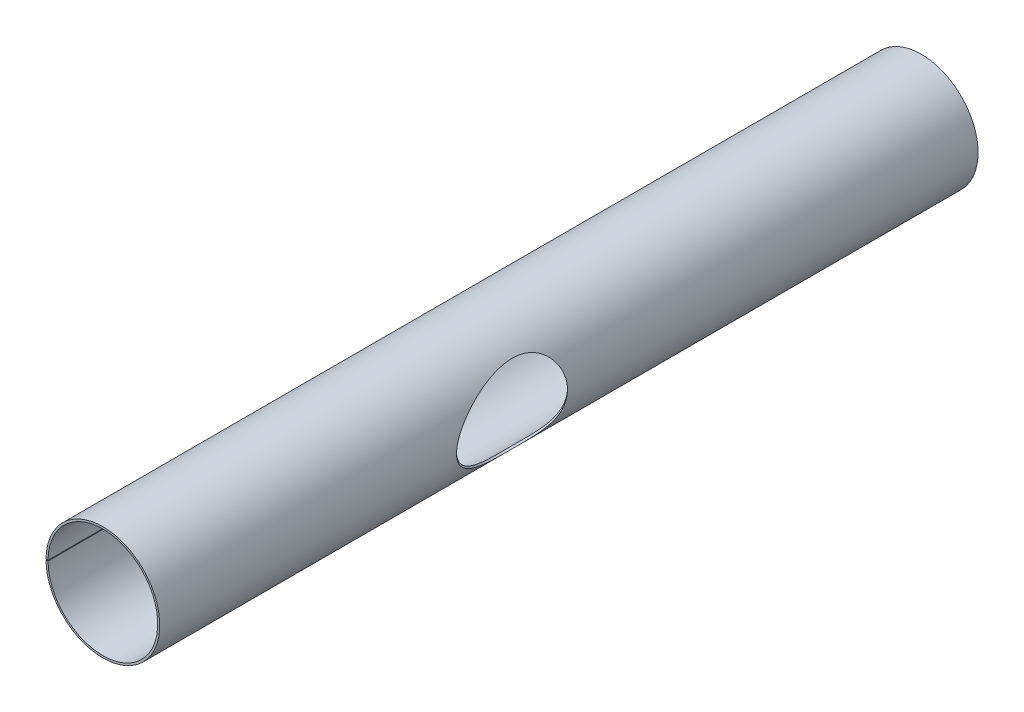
ISO-10303-21;
HEADER;
FILE_DESCRIPTION(('STEP AP214'),'2;1');
FILE_NAME('part.step','',(''),(''),'','','');
FILE_SCHEMA(('AUTOMOTIVE_DESIGN { 1 0 10303 214 1 1 1 1 }'));
ENDSEC;
DATA;
#1=APPLICATION_CONTEXT('core data for automotive mechanical design processes');
#2=APPLICATION_PROTOCOL_DEFINITION('international standard','automotive_design',2000,#1);
#3=PRODUCT_CONTEXT('',#1,'mechanical');
#4=PRODUCT('Part','Part','',(#3));
#5=PRODUCT_RELATED_PRODUCT_CATEGORY('part','',(#4));
#6=PRODUCT_DEFINITION_FORMATION('','',#4);
#7=PRODUCT_DEFINITION_CONTEXT('part definition',#1,'design');
#8=PRODUCT_DEFINITION('design','',#6,#7);
#9=PRODUCT_DEFINITION_SHAPE('','',#8);
#10=(LENGTH_UNIT() NAMED_UNIT(*) SI_UNIT(.MILLI.,.METRE.));
#11=(NAMED_UNIT(*) PLANE_ANGLE_UNIT() SI_UNIT($,.RADIAN.));
#12=(NAMED_UNIT(*) SI_UNIT($,.STERADIAN.) SOLID_ANGLE_UNIT());
#13=UNCERTAINTY_MEASURE_WITH_UNIT(LENGTH_MEASURE(1.E-05),#10,'distance_accuracy_value','');
#14=(GEOMETRIC_REPRESENTATION_CONTEXT(3) GLOBAL_UNCERTAINTY_ASSIGNED_CONTEXT((#13)) GLOBAL_UNIT_ASSIGNED_CONTEXT((#10,
#11,#12)) REPRESENTATION_CONTEXT('',''));
#15=CARTESIAN_POINT('',(0.,0.,0.));
#16=DIRECTION('',(0.,0.,1.));
#17=DIRECTION('',(1.,0.,0.));
#18=AXIS2_PLACEMENT_3D('',#15,#16,#17);
#19=CARTESIAN_POINT('',(0.,0.,500.));
#20=DIRECTION('',(0.,0.,-1.));
#21=DIRECTION('',(-1.,0.,0.));
#22=AXIS2_PLACEMENT_3D('',#19,#20,#21);
#23=CYLINDRICAL_SURFACE('',#22,69.5);
#24=CARTESIAN_POINT('',(69.5,0.,1.61774900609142));
#25=CARTESIAN_POINT('',(69.4999893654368,-1.3417271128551,1.61775043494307));
#26=CARTESIAN_POINT('',(69.4610710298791,-2.68385227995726,1.65845766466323));
#27=CARTESIAN_POINT('',(69.3060443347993,-5.35901378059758,1.82146461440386));
#28=CARTESIAN_POINT('',(69.1899032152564,-6.692046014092,1.9437989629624));
#29=CARTESIAN_POINT('',(68.882250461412,-9.34168040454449,2.27082133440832));
#30=CARTESIAN_POINT('',(68.6906057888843,-10.6582493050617,2.47565473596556));
#31=CARTESIAN_POINT('',(68.2355678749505,-13.2629330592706,2.9683753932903));
#32=CARTESIAN_POINT('',(67.9721822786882,-14.5510509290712,3.25625379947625));
#33=CARTESIAN_POINT('',(67.3786956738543,-17.0897429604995,3.91615355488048));
#34=CARTESIAN_POINT('',(67.0486084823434,-18.3403248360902,4.28815747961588));
#35=CARTESIAN_POINT('',(66.5085375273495,-20.1810397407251,4.9101963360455));
#36=CARTESIAN_POINT('',(66.3209911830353,-20.7888435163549,5.12825367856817));
#37=CARTESIAN_POINT('',(65.9318952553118,-21.9916897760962,5.58594779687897));
#38=CARTESIAN_POINT('',(65.7303470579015,-22.5867335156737,5.82558243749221));
#39=CARTESIAN_POINT('',(65.3143375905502,-23.7629226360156,6.32663504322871));
#40=CARTESIAN_POINT('',(65.0998770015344,-24.3440687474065,6.58805185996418));
#41=CARTESIAN_POINT('',(64.6592511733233,-25.4913469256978,7.13288135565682));
#42=CARTESIAN_POINT('',(64.4330871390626,-26.0574805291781,7.41629177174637));
#43=CARTESIAN_POINT('',(63.9703258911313,-27.1737464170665,8.00538399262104));
#44=CARTESIAN_POINT('',(63.7337277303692,-27.7238772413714,8.31106782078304));
#45=CARTESIAN_POINT('',(63.2515737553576,-28.8069391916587,8.94486846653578));
#46=CARTESIAN_POINT('',(63.0060189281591,-29.3398722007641,9.27298281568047));
#47=CARTESIAN_POINT('',(62.5113730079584,-30.3793408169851,9.94656619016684));
#48=CARTESIAN_POINT('',(62.2623970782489,-30.8861587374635,10.2916840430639));
#49=CARTESIAN_POINT('',(61.7588658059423,-31.8810807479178,11.0039866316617));
#50=CARTESIAN_POINT('',(61.5043111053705,-32.3691869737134,11.3711688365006));
#51=CARTESIAN_POINT('',(60.9912650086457,-33.3258191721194,12.1277793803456));
#52=CARTESIAN_POINT('',(60.732773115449,-33.7943426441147,12.5172105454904));
#53=CARTESIAN_POINT('',(60.2137218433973,-34.7107327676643,13.3182477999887));
#54=CARTESIAN_POINT('',(59.9531627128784,-35.1586018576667,13.7298512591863));
#55=CARTESIAN_POINT('',(59.4321166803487,-36.0323741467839,14.5747503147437));
#56=CARTESIAN_POINT('',(59.1716299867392,-36.4582997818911,15.0080228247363));
#57=CARTESIAN_POINT('',(58.6524524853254,-37.2877888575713,15.8963908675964));
#58=CARTESIAN_POINT('',(58.3937614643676,-37.6913549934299,16.3514837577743));
#59=CARTESIAN_POINT('',(57.8801619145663,-38.4754011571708,17.2831601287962));
#60=CARTESIAN_POINT('',(57.6252532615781,-38.8558819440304,17.7597429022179));
#61=CARTESIAN_POINT('',(57.121233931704,-39.5931057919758,18.7338680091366));
#62=CARTESIAN_POINT('',(56.8721231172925,-39.9498494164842,19.2314098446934));
#63=CARTESIAN_POINT('',(56.4032800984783,-40.6087280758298,20.2020174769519));
#64=CARTESIAN_POINT('',(56.1828922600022,-40.9129057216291,20.6733817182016));
#65=CARTESIAN_POINT('',(55.7500202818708,-41.5008254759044,21.6322817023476));
#66=CARTESIAN_POINT('',(55.5375368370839,-41.7845657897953,22.1198188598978));
#67=CARTESIAN_POINT('',(55.121903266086,-42.33135610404,23.1100914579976));
#68=CARTESIAN_POINT('',(54.918751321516,-42.594410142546,23.6128239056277));
#69=CARTESIAN_POINT('',(54.5229636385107,-43.0998780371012,24.6326661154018));
#70=CARTESIAN_POINT('',(54.3303289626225,-43.342289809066,25.1497773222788));
#71=CARTESIAN_POINT('',(53.9567492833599,-43.8064834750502,26.1971338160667));
#72=CARTESIAN_POINT('',(53.7758010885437,-44.0282710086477,26.727375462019));
#73=CARTESIAN_POINT('',(53.4264493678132,-44.4515430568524,27.7999757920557));
#74=CARTESIAN_POINT('',(53.2580473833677,-44.6530250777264,28.3423359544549));
#75=CARTESIAN_POINT('',(52.7728504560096,-45.2275215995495,29.9858449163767));
#76=CARTESIAN_POINT('',(52.4759920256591,-45.5706756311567,31.1036245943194));
#77=CARTESIAN_POINT('',(52.0505705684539,-46.0547952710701,32.9024059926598));
#78=CARTESIAN_POINT('',(51.9032261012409,-46.2206384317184,33.5725719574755));
#79=CARTESIAN_POINT('',(51.6282701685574,-46.5275652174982,34.9226368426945));
#80=CARTESIAN_POINT('',(51.5006595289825,-46.6686478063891,35.6025361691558));
#81=CARTESIAN_POINT('',(51.2651449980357,-46.9272357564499,36.9702035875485));
#82=CARTESIAN_POINT('',(51.1572427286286,-47.0447391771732,37.6579723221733));
#83=CARTESIAN_POINT('',(50.9608084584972,-47.2574539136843,39.0397571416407));
#84=CARTESIAN_POINT('',(50.8722786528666,-47.3526627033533,39.7337739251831));
#85=CARTESIAN_POINT('',(50.7139411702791,-47.5222019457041,41.1275787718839));
#86=CARTESIAN_POINT('',(50.6441630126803,-47.5964994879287,41.8273741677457));
#87=CARTESIAN_POINT('',(50.5227942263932,-47.7253068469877,43.2303784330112));
#88=CARTESIAN_POINT('',(50.4712054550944,-47.7798146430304,43.9335876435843));
#89=CARTESIAN_POINT('',(50.3425212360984,-47.9155229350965,46.046476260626));
#90=CARTESIAN_POINT('',(50.2914808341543,-47.9689370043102,47.4596603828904));
#91=CARTESIAN_POINT('',(50.2548202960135,-48.0073189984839,50.0583301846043));
#92=CARTESIAN_POINT('',(50.2599427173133,-48.0019722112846,51.2436207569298));
#93=CARTESIAN_POINT('',(50.3093813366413,-47.950156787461,53.6126464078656));
#94=CARTESIAN_POINT('',(50.3537038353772,-47.9036815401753,54.7963812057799));
#95=CARTESIAN_POINT('',(50.4773122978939,-47.7734117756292,57.1606238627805));
#96=CARTESIAN_POINT('',(50.5566203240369,-47.6895937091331,58.3411292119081));
#97=CARTESIAN_POINT('',(50.7462107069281,-47.4878007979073,60.6966151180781));
#98=CARTESIAN_POINT('',(50.8564917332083,-47.3698274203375,61.871595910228));
#99=CARTESIAN_POINT('',(51.104921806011,-47.1017034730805,64.2198760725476));
#100=CARTESIAN_POINT('',(51.2431847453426,-46.9514212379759,65.3931481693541));
#101=CARTESIAN_POINT('',(51.5440008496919,-46.6209810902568,67.7323143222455));
#102=CARTESIAN_POINT('',(51.7065540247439,-46.4408231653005,68.8982083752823));
#103=CARTESIAN_POINT('',(52.0529623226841,-46.0522185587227,71.2216499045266));
#104=CARTESIAN_POINT('',(52.236810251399,-45.8437814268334,72.3792000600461));
#105=CARTESIAN_POINT('',(52.6232607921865,-45.3996594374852,74.6859535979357));
#106=CARTESIAN_POINT('',(52.8258642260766,-45.1639733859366,75.8351566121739));
#107=CARTESIAN_POINT('',(53.2045617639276,-44.7167986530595,77.8915489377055));
#108=CARTESIAN_POINT('',(53.3776495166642,-44.5101598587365,78.8003536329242));
#109=CARTESIAN_POINT('',(53.7332011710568,-44.0802779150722,80.6122051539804));
#110=CARTESIAN_POINT('',(53.9156652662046,-43.8570344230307,81.5152518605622));
#111=CARTESIAN_POINT('',(54.2890108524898,-43.3940289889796,83.3154241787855));
#112=CARTESIAN_POINT('',(54.4798929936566,-43.1542657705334,84.2125493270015));
#113=CARTESIAN_POINT('',(54.8691732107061,-42.658214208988,86.0005995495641));
#114=CARTESIAN_POINT('',(55.0675714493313,-42.4019255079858,86.8915244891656));
#115=CARTESIAN_POINT('',(55.4712791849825,-41.8724033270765,88.6678998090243));
#116=CARTESIAN_POINT('',(55.6765962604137,-41.5991509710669,89.553342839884));
#117=CARTESIAN_POINT('',(56.0931490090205,-41.0357329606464,91.3174293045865));
#118=CARTESIAN_POINT('',(56.3043846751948,-40.7455673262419,92.1960727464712));
#119=CARTESIAN_POINT('',(56.7320301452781,-40.1479980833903,93.9461705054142));
#120=CARTESIAN_POINT('',(56.9484397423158,-39.8405951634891,94.817625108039));
#121=CARTESIAN_POINT('',(57.3857322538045,-39.2081057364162,96.5529394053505));
#122=CARTESIAN_POINT('',(57.6066150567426,-38.8830196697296,97.4167992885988));
#123=CARTESIAN_POINT('',(58.0519985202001,-38.2148733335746,99.1357558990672));
#124=CARTESIAN_POINT('',(58.2764961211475,-37.8718277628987,99.990859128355));
#125=CARTESIAN_POINT('',(58.7286078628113,-37.1668665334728,101.692392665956));
#126=CARTESIAN_POINT('',(58.9562219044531,-36.8049514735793,102.538823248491));
#127=CARTESIAN_POINT('',(59.4139448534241,-36.0613893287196,104.222478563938));
#128=CARTESIAN_POINT('',(59.6440541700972,-35.6797389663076,105.059701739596));
#129=CARTESIAN_POINT('',(60.1060506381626,-34.8958403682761,106.723957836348));
#130=CARTESIAN_POINT('',(60.3379377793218,-34.493592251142,107.550990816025));
#131=CARTESIAN_POINT('',(60.8023893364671,-33.6681356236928,109.192462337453));
#132=CARTESIAN_POINT('',(61.034951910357,-33.2449642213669,110.006920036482));
#133=CARTESIAN_POINT('',(61.5004143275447,-32.3757948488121,111.623511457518));
#134=CARTESIAN_POINT('',(61.7333141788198,-31.9297963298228,112.425644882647));
#135=CARTESIAN_POINT('',(62.1985694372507,-31.0137356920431,114.015865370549));
#136=CARTESIAN_POINT('',(62.4309249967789,-30.5436814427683,114.803956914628));
#137=CARTESIAN_POINT('',(62.8942680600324,-29.5778287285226,116.364554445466));
#138=CARTESIAN_POINT('',(63.1252556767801,-29.0820324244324,117.137061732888));
#139=CARTESIAN_POINT('',(63.5645395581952,-28.107986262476,118.596806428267));
#140=CARTESIAN_POINT('',(63.7730344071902,-27.6320684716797,119.285538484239));
#141=CARTESIAN_POINT('',(64.1872102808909,-26.6558287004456,120.646347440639));
#142=CARTESIAN_POINT('',(64.3928914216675,-26.1555077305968,121.318425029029));
#143=CARTESIAN_POINT('',(64.8006033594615,-25.1284167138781,122.64404721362));
#144=CARTESIAN_POINT('',(65.00263149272,-24.6016283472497,123.297578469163));
#145=CARTESIAN_POINT('',(65.4017322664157,-23.5201121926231,124.582723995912));
#146=CARTESIAN_POINT('',(65.5988049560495,-22.9653846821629,125.214338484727));
#147=CARTESIAN_POINT('',(65.9850699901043,-21.8306405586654,126.447145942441));
#148=CARTESIAN_POINT('',(66.1743130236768,-21.2508636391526,127.048542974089));
#149=CARTESIAN_POINT('',(66.5450181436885,-20.0598992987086,128.222172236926));
#150=CARTESIAN_POINT('',(66.7264794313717,-19.4487086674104,128.794401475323));
#151=CARTESIAN_POINT('',(67.0794296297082,-18.1940688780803,129.903631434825));
#152=CARTESIAN_POINT('',(67.2509336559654,-17.5506715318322,130.440685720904));
#153=CARTESIAN_POINT('',(67.5819737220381,-16.2293090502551,131.474186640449));
#154=CARTESIAN_POINT('',(67.7415142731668,-15.551357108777,131.970648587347));
#155=CARTESIAN_POINT('',(68.0183446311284,-14.286161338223,132.829825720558));
#156=CARTESIAN_POINT('',(68.1380437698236,-13.704822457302,133.200450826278));
#157=CARTESIAN_POINT('',(68.3660150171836,-12.5181051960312,133.904971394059));
#158=CARTESIAN_POINT('',(68.4742883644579,-11.9127294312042,134.238870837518));
#159=CARTESIAN_POINT('',(68.6776280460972,-10.6782383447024,134.864916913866));
#160=CARTESIAN_POINT('',(68.772689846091,-10.0491149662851,135.157049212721));
#161=CARTESIAN_POINT('',(68.9476103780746,-8.76893238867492,135.693871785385));
#162=CARTESIAN_POINT('',(69.0274723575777,-8.11787791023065,135.938572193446));
#163=CARTESIAN_POINT('',(69.1708636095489,-6.78916686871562,136.377473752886));
#164=CARTESIAN_POINT('',(69.2342065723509,-6.11129852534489,136.571099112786));
#165=CARTESIAN_POINT('',(69.3415984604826,-4.73979632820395,136.89913679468));
#166=CARTESIAN_POINT('',(69.3856480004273,-4.04616297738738,137.033551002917));
#167=CARTESIAN_POINT('',(69.4530054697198,-2.64923120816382,137.239010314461));
#168=CARTESIAN_POINT('',(69.4763344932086,-1.94594336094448,137.310119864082));
#169=CARTESIAN_POINT('',(69.5015155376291,-0.535427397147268,137.386872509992));
#170=CARTESIAN_POINT('',(69.5033694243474,0.171800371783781,137.392521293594));
#171=CARTESIAN_POINT('',(69.4864326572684,1.51335646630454,137.340900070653));
#172=CARTESIAN_POINT('',(69.469671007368,2.14795913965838,137.289813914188));
#173=CARTESIAN_POINT('',(69.4191632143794,3.41007365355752,137.135792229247));
#174=CARTESIAN_POINT('',(69.3854185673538,4.03758611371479,137.032861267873));
#175=CARTESIAN_POINT('',(69.3018191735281,5.28175335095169,136.777652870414));
#176=CARTESIAN_POINT('',(69.2519543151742,5.89840105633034,136.625344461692));
#177=CARTESIAN_POINT('',(69.1373405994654,7.11709175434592,136.274893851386));
#178=CARTESIAN_POINT('',(69.0725895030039,7.71913253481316,136.076744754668));
#179=CARTESIAN_POINT('',(68.9059892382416,9.102001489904,135.56625568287));
#180=CARTESIAN_POINT('',(68.7989485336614,9.87628926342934,135.237809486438));
#181=CARTESIAN_POINT('',(68.5644606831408,11.3909110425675,134.516733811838));
#182=CARTESIAN_POINT('',(68.4370067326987,12.1312336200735,134.12408293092));
#183=CARTESIAN_POINT('',(68.0285255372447,14.3017586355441,132.862428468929));
#184=CARTESIAN_POINT('',(67.7216231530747,15.6796141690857,131.910467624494));
#185=CARTESIAN_POINT('',(67.2546859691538,17.5320531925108,130.452259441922));
#186=CARTESIAN_POINT('',(67.1134075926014,18.0647013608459,130.009934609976));
#187=CARTESIAN_POINT('',(66.8240481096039,19.1073036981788,129.101336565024));
#188=CARTESIAN_POINT('',(66.6759684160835,19.617262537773,128.635068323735));
#189=CARTESIAN_POINT('',(66.374036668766,20.6157605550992,127.681346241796));
#190=CARTESIAN_POINT('',(66.2201805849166,21.1042842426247,127.193877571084));
#191=CARTESIAN_POINT('',(65.9077280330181,22.0606988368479,126.200549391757));
#192=CARTESIAN_POINT('',(65.7491313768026,22.5285889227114,125.694689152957));
#193=CARTESIAN_POINT('',(65.4277590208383,23.4455714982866,124.665896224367));
#194=CARTESIAN_POINT('',(65.2649766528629,23.894630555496,124.142935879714));
#195=CARTESIAN_POINT('',(64.936221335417,24.774127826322,123.082635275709));
#196=CARTESIAN_POINT('',(64.7702484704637,25.2045665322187,122.545295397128));
#197=CARTESIAN_POINT('',(64.2685686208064,26.4693171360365,120.91431614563));
#198=CARTESIAN_POINT('',(63.928998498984,27.2773505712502,119.801391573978));
#199=CARTESIAN_POINT('',(63.2439725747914,28.8300057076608,117.534772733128));
#200=CARTESIAN_POINT('',(62.8985184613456,29.5746452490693,116.381090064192));
#201=CARTESIAN_POINT('',(62.2048702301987,31.0070527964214,114.039513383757));
#202=CARTESIAN_POINT('',(61.856675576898,31.6948093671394,112.851612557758));
#203=CARTESIAN_POINT('',(61.1601536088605,33.0188656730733,110.446224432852));
#204=CARTESIAN_POINT('',(60.8118264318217,33.6551213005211,109.228712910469));
#205=CARTESIAN_POINT('',(60.1178476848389,34.8796430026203,106.769211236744));
#206=CARTESIAN_POINT('',(59.7721959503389,35.4679120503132,105.527222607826));
#207=CARTESIAN_POINT('',(59.0843918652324,36.6022727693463,103.016471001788));
#208=CARTESIAN_POINT('',(58.7422606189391,37.1481746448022,101.747616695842));
#209=CARTESIAN_POINT('',(58.0652462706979,38.1977365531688,99.1906653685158));
#210=CARTESIAN_POINT('',(57.7303632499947,38.7013961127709,97.9025681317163));
#211=CARTESIAN_POINT('',(57.0702687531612,39.6683358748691,95.309607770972));
#212=CARTESIAN_POINT('',(56.7450527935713,40.131634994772,94.0047528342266));
#213=CARTESIAN_POINT('',(56.1064844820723,41.0196467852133,91.3791146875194));
#214=CARTESIAN_POINT('',(55.793132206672,41.4443592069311,90.058331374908));
#215=CARTESIAN_POINT('',(55.1413168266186,42.3085650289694,87.2306075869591));
#216=CARTESIAN_POINT('',(54.8048286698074,42.7428979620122,85.7216312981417));
#217=CARTESIAN_POINT('',(54.1542032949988,43.5642822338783,82.6860448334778));
#218=CARTESIAN_POINT('',(53.840066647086,43.9513323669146,81.1594342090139));
#219=CARTESIAN_POINT('',(53.238485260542,44.6781419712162,78.0883860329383));
#220=CARTESIAN_POINT('',(52.9510625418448,45.0178625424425,76.543934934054));
#221=CARTESIAN_POINT('',(52.4085168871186,45.6483330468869,73.4394268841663));
#222=CARTESIAN_POINT('',(52.1533930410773,45.9390843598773,71.8793703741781));
#223=CARTESIAN_POINT('',(51.683042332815,46.4675966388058,68.7539490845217));
#224=CARTESIAN_POINT('',(51.4675891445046,46.7056598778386,67.1886698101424));
#225=CARTESIAN_POINT('',(51.0818542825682,47.1272322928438,64.0448579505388));
#226=CARTESIAN_POINT('',(50.9115775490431,47.3107355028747,62.4663239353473));
#227=CARTESIAN_POINT('',(50.6964697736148,47.5408120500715,60.0917023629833));
#228=CARTESIAN_POINT('',(50.6315150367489,47.6099433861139,59.2995565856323));
#229=CARTESIAN_POINT('',(50.5161373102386,47.7323474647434,57.712998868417));
#230=CARTESIAN_POINT('',(50.465713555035,47.7856210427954,56.918587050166));
#231=CARTESIAN_POINT('',(50.3806289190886,47.8753177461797,55.3281755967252));
#232=CARTESIAN_POINT('',(50.3459637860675,47.9117454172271,54.5321764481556));
#233=CARTESIAN_POINT('',(50.2936669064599,47.9666397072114,52.9390376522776));
#234=CARTESIAN_POINT('',(50.2760338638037,47.9851076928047,52.1418980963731));
#235=CARTESIAN_POINT('',(50.2605817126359,48.0012920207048,50.6839229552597));
#236=CARTESIAN_POINT('',(50.2598836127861,48.0020235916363,50.0231522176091));
#237=CARTESIAN_POINT('',(50.2718628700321,47.9894757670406,48.7019117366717));
#238=CARTESIAN_POINT('',(50.2845395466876,47.9761970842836,48.0414419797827));
#239=CARTESIAN_POINT('',(50.3437902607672,47.9140573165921,46.0613895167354));
#240=CARTESIAN_POINT('',(50.4115824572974,47.8428951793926,44.742968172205));
#241=CARTESIAN_POINT('',(50.6095551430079,47.6334356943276,42.1169375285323));
#242=CARTESIAN_POINT('',(50.7396847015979,47.4951931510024,40.8093202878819));
#243=CARTESIAN_POINT('',(50.9850300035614,47.2312451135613,38.8619687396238));
#244=CARTESIAN_POINT('',(51.0751853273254,47.1338152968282,38.2151136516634));
#245=CARTESIAN_POINT('',(51.2725722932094,46.9190236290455,36.9273691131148));
#246=CARTESIAN_POINT('',(51.379802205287,46.8016637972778,36.2864790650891));
#247=CARTESIAN_POINT('',(51.6130582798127,46.5443092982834,35.0037204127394));
#248=CARTESIAN_POINT('',(51.7393114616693,46.4040392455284,34.3619481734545));
#249=CARTESIAN_POINT('',(52.0095190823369,46.100988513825,33.0875755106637));
#250=CARTESIAN_POINT('',(52.1534713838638,45.938210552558,32.4549739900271));
#251=CARTESIAN_POINT('',(52.4588273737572,45.5892003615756,31.2004437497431));
#252=CARTESIAN_POINT('',(52.6202331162,45.4029653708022,30.5785162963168));
#253=CARTESIAN_POINT('',(52.9598951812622,45.0063068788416,29.3471819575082));
#254=CARTESIAN_POINT('',(53.1381493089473,44.7958865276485,28.7377734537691));
#255=CARTESIAN_POINT('',(53.5105826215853,44.3503303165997,27.5333439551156));
#256=CARTESIAN_POINT('',(53.7047546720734,44.1152055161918,26.9383166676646));
#257=CARTESIAN_POINT('',(54.1079178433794,43.6197797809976,25.7640599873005));
#258=CARTESIAN_POINT('',(54.3169070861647,43.3594820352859,25.1848286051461));
#259=CARTESIAN_POINT('',(54.7483050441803,42.8134806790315,24.0435972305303));
#260=CARTESIAN_POINT('',(54.9707136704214,42.5277772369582,23.4815971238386));
#261=CARTESIAN_POINT('',(55.4272954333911,41.9309676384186,22.3761855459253));
#262=CARTESIAN_POINT('',(55.6614682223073,41.6198622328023,21.8327735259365));
#263=CARTESIAN_POINT('',(56.1108423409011,41.0115661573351,20.8301612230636));
#264=CARTESIAN_POINT('',(56.3249184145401,40.7172341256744,20.3687177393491));
#265=CARTESIAN_POINT('',(56.7594218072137,40.1093208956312,19.461707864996));
#266=CARTESIAN_POINT('',(56.9798496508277,39.7957381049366,19.0161427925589));
#267=CARTESIAN_POINT('',(57.4256061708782,39.1497600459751,18.1415516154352));
#268=CARTESIAN_POINT('',(57.6509339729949,38.8173681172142,17.7125225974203));
#269=CARTESIAN_POINT('',(58.1051334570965,38.1341286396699,16.8712940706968));
#270=CARTESIAN_POINT('',(58.3340054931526,37.7832792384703,16.4590962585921));
#271=CARTESIAN_POINT('',(58.7939505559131,37.0635103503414,15.6517075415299));
#272=CARTESIAN_POINT('',(59.025024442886,36.6945835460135,15.2565236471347));
#273=CARTESIAN_POINT('',(59.4878872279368,35.9393600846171,14.4835291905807));
#274=CARTESIAN_POINT('',(59.7196761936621,35.5530617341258,14.1057203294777));
#275=CARTESIAN_POINT('',(60.4140164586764,34.3690665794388,12.9986139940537));
#276=CARTESIAN_POINT('',(60.875648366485,33.5461033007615,12.2954506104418));
#277=CARTESIAN_POINT('',(61.7841905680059,31.8416931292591,10.961811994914));
#278=CARTESIAN_POINT('',(62.2311485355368,30.9604711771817,10.331080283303));
#279=CARTESIAN_POINT('',(63.1030269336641,29.1423112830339,9.13850676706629));
#280=CARTESIAN_POINT('',(63.5279476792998,28.2053741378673,8.57666397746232));
#281=CARTESIAN_POINT('',(64.3478760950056,26.2810800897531,7.52057234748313));
#282=CARTESIAN_POINT('',(64.742870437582,25.2937010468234,7.02635354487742));
#283=CARTESIAN_POINT('',(65.4957976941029,23.2746973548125,6.10458062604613));
#284=CARTESIAN_POINT('',(65.8537293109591,22.2430711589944,5.67702884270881));
#285=CARTESIAN_POINT('',(66.5608759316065,20.0344033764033,4.84722141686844));
#286=CARTESIAN_POINT('',(66.905494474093,18.8532493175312,4.45197143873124));
#287=CARTESIAN_POINT('',(67.5360427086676,16.4521763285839,3.73960004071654));
#288=CARTESIAN_POINT('',(67.8219630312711,15.2322512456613,3.42249109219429));
#289=CARTESIAN_POINT('',(68.3295387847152,12.7636155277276,2.86576383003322));
#290=CARTESIAN_POINT('',(68.5512838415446,11.5149476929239,2.62603739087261));
#291=CARTESIAN_POINT('',(68.9271075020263,8.99582786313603,2.22273368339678));
#292=CARTESIAN_POINT('',(69.0812127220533,7.72538464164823,2.05912646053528));
#293=CARTESIAN_POINT('',(69.2997783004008,5.3797798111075,1.82800460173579));
#294=CARTESIAN_POINT('',(69.3747856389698,4.30670557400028,1.74914197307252));
#295=CARTESIAN_POINT('',(69.4498692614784,2.69362011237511,1.67030108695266));
#296=CARTESIAN_POINT('',(69.46865923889,2.15534022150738,1.65059630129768));
#297=CARTESIAN_POINT('',(69.4937281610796,1.07806172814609,1.62431848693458));
#298=CARTESIAN_POINT('',(69.500004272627,0.539062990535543,1.61774843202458));
#299=CARTESIAN_POINT('',(69.5,0.,1.61774900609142));
#300=B_SPLINE_CURVE_WITH_KNOTS('',3,(#24,#25,#26,#27,#28,#29,#30,#31,#32,#33,#34,#35,#36,#37,
#38,#39,#40,#41,#42,#43,#44,#45,#46,#47,#48,#49,#50,#51,#52,#53,#54,#55,#56,#57,#58,#59,#60,#61,
#62,#63,#64,#65,#66,#67,#68,#69,#70,#71,#72,#73,#74,#75,#76,#77,#78,#79,#80,#81,#82,#83,#84,#85,
#86,#87,#88,#89,#90,#91,#92,#93,#94,#95,#96,#97,#98,#99,#100,#101,#102,#103,#104,#105,#106,#107,
#108,#109,#110,#111,#112,#113,#114,#115,#116,#117,#118,#119,#120,#121,#122,#123,#124,#125,#126,
#127,#128,#129,#130,#131,#132,#133,#134,#135,#136,#137,#138,#139,#140,#141,#142,#143,#144,#145,
#146,#147,#148,#149,#150,#151,#152,#153,#154,#155,#156,#157,#158,#159,#160,#161,#162,#163,#164,
#165,#166,#167,#168,#169,#170,#171,#172,#173,#174,#175,#176,#177,#178,#179,#180,#181,#182,#183,
#184,#185,#186,#187,#188,#189,#190,#191,#192,#193,#194,#195,#196,#197,#198,#199,#200,#201,#202,
#203,#204,#205,#206,#207,#208,#209,#210,#211,#212,#213,#214,#215,#216,#217,#218,#219,#220,#221,
#222,#223,#224,#225,#226,#227,#228,#229,#230,#231,#232,#233,#234,#235,#236,#237,#238,#239,#240,
#241,#242,#243,#244,#245,#246,#247,#248,#249,#250,#251,#252,#253,#254,#255,#256,#257,#258,#259,
#260,#261,#262,#263,#264,#265,#266,#267,#268,#269,#270,#271,#272,#273,#274,#275,#276,#277,#278,
#279,#280,#281,#282,#283,#284,#285,#286,#287,#288,#289,#290,#291,#292,#293,#294,#295,#296,#297,
#298,#299),.UNSPECIFIED.,.T.,.F.,(4,2,2,2,2,2,2,2,2,2,2,2,2,2,2,2,2,2,2,2,2,2,2,2,2,2,2,2,2,2,2,
2,2,2,2,2,2,2,2,2,2,2,2,2,2,2,2,2,2,2,2,2,2,2,2,2,2,2,2,2,2,2,2,2,2,2,2,2,2,2,2,2,2,2,2,2,2,2,2,
2,2,2,2,2,2,2,2,2,2,2,2,2,2,2,2,2,2,2,2,2,2,2,2,2,2,2,2,2,2,2,2,2,2,2,2,2,2,2,2,2,2,2,2,2,2,2,2,
2,2,2,2,2,2,2,2,2,2,4),(0.,4.02468972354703,8.05108792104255,12.0846126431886,16.1177076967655,
20.1499681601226,22.1667257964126,24.1832840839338,26.1997361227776,28.215980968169,
30.2324092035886,32.2486158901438,34.2333266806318,36.2178102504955,38.2025464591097,
40.1870477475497,42.1694779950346,44.1516687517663,46.1337943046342,48.1158727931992,
49.9234503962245,51.7311865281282,53.5385688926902,55.3461335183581,57.1532024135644,
58.9604929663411,62.5743782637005,64.6915321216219,66.8087745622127,68.9261911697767,
71.0438475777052,73.1648183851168,75.2860057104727,79.527641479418,83.0822308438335,
86.6373916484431,90.1947975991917,93.7520507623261,97.3240849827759,100.896120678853,
104.466953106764,108.037942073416,110.881550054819,113.725216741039,116.569103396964,
119.413051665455,122.260223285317,125.107391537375,127.954446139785,130.801429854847,
133.646118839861,136.490717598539,139.335790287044,142.180846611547,145.021026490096,
147.86127467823,150.700599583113,153.539686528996,156.127444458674,158.715095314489,
161.304562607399,163.894004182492,166.462588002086,169.031434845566,171.596274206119,
174.160141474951,176.258086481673,178.355803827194,180.454239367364,182.552226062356,
184.6729408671,186.793588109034,188.912073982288,191.030375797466,192.938614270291,
194.846684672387,196.755954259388,198.665511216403,201.205029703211,203.74539647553,
208.832233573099,210.951818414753,213.070964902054,215.191618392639,217.312356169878,
219.436712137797,221.561011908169,225.80827635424,230.054341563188,234.301258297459,
238.551774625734,242.802027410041,247.070336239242,251.338692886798,255.605038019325,
259.871410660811,264.688126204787,269.504964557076,274.325738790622,279.146377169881,
283.938597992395,288.731342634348,291.124519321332,293.517569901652,295.909974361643,
298.302196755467,300.284234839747,302.266172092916,306.229461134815,310.189517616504,
312.17006364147,314.150409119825,316.156596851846,318.16254256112,320.168724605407,
322.174645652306,324.179672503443,326.184445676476,328.189205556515,330.193906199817,
331.95644918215,333.71913814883,335.481515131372,337.244069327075,339.007342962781,
340.770788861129,344.296867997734,347.810048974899,351.323179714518,354.837865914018,
358.352675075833,362.225282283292,366.098507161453,369.966296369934,373.832562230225,
377.065744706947,378.682370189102,380.299361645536),.UNSPECIFIED.);
#301=CARTESIAN_POINT('',(69.5,0.,1.61774900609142));
#302=VERTEX_POINT('',#301);
#303=EDGE_CURVE('E107',#302,#302,#300,.T.);
#304=ORIENTED_EDGE('',*,*,#303,.T.);
#305=EDGE_LOOP('',(#304));
#306=FACE_BOUND('',#305,.T.);
#307=CARTESIAN_POINT('',(0.,0.,-500.));
#308=DIRECTION('',(0.,0.,1.));
#309=DIRECTION('',(1.,0.,0.));
#310=AXIS2_PLACEMENT_3D('',#307,#308,#309);
#311=CIRCLE('',#310,69.5);
#312=CARTESIAN_POINT('',(-69.4982014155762,-0.49999999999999,-500.));
#313=VERTEX_POINT('',#312);
#314=CARTESIAN_POINT('',(-69.4982014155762,0.499999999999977,-500.));
#315=VERTEX_POINT('',#314);
#316=EDGE_CURVE('E105',#313,#315,#311,.T.);
#317=ORIENTED_EDGE('',*,*,#316,.T.);
#318=DIRECTION('',(0.,0.,-1.));
#319=VECTOR('',#318,1.);
#320=CARTESIAN_POINT('',(-69.4982014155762,0.499999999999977,500.));
#321=LINE('',#320,#319);
#322=CARTESIAN_POINT('',(-69.4982014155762,0.499999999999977,500.));
#323=VERTEX_POINT('',#322);
#324=EDGE_CURVE('E11',#323,#315,#321,.T.);
#325=ORIENTED_EDGE('',*,*,#324,.F.);
#326=CARTESIAN_POINT('',(0.,0.,500.));
#327=DIRECTION('',(0.,0.,1.));
#328=DIRECTION('',(1.,0.,0.));
#329=AXIS2_PLACEMENT_3D('',#326,#327,#328);
#330=CIRCLE('',#329,69.5);
#331=CARTESIAN_POINT('',(-69.4982014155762,-0.49999999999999,500.));
#332=VERTEX_POINT('',#331);
#333=EDGE_CURVE('E81',#332,#323,#330,.T.);
#334=ORIENTED_EDGE('',*,*,#333,.F.);
#335=DIRECTION('',(0.,0.,-1.));
#336=VECTOR('',#335,1.);
#337=CARTESIAN_POINT('',(-69.4982014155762,-0.49999999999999,500.));
#338=LINE('',#337,#336);
#339=EDGE_CURVE('E57',#332,#313,#338,.T.);
#340=ORIENTED_EDGE('',*,*,#339,.T.);
#341=EDGE_LOOP('',(#317,#325,#334,#340));
#342=FACE_BOUND('',#341,.T.);
#343=ADVANCED_FACE('F35',(#306,#342),#23,.T.);
#344=CARTESIAN_POINT('',(-67.0382650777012,0.482302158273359,500.));
#345=DIRECTION('',(-0.00719424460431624,-0.999974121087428,0.));
#346=DIRECTION('',(0.999974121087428,-0.00719424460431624,0.));
#347=AXIS2_PLACEMENT_3D('',#344,#345,#346);
#348=PLANE('',#347);
#349=DIRECTION('',(-0.999974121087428,0.00719424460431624,0.));
#350=VECTOR('',#349,1.);
#351=CARTESIAN_POINT('',(-67.0382650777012,0.482302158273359,-500.));
#352=LINE('',#351,#350);
#353=CARTESIAN_POINT('',(-67.0382650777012,0.482302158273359,-500.));
#354=VERTEX_POINT('',#353);
#355=EDGE_CURVE('E90',#354,#315,#352,.T.);
#356=ORIENTED_EDGE('',*,*,#355,.F.);
#357=DIRECTION('',(0.,0.,-1.));
#358=VECTOR('',#357,1.);
#359=CARTESIAN_POINT('',(-67.0382650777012,0.482302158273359,500.));
#360=LINE('',#359,#358);
#361=CARTESIAN_POINT('',(-67.0382650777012,0.482302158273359,500.));
#362=VERTEX_POINT('',#361);
#363=EDGE_CURVE('E49',#362,#354,#360,.T.);
#364=ORIENTED_EDGE('',*,*,#363,.F.);
#365=DIRECTION('',(-0.999974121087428,0.00719424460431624,0.));
#366=VECTOR('',#365,1.);
#367=CARTESIAN_POINT('',(-67.0382650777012,0.482302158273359,500.));
#368=LINE('',#367,#366);
#369=EDGE_CURVE('E88',#362,#323,#368,.T.);
#370=ORIENTED_EDGE('',*,*,#369,.T.);
#371=ORIENTED_EDGE('',*,*,#324,.T.);
#372=EDGE_LOOP('',(#356,#364,#370,#371));
#373=FACE_BOUND('',#372,.T.);
#374=ADVANCED_FACE('F87',(#373),#348,.T.);
#375=CARTESIAN_POINT('',(0.,0.,500.));
#376=DIRECTION('',(0.,0.,-1.));
#377=DIRECTION('',(-1.,0.,0.));
#378=AXIS2_PLACEMENT_3D('',#375,#376,#377);
#379=CYLINDRICAL_SURFACE('',#378,67.04);
#380=CARTESIAN_POINT('',(67.04,0.,-0.842250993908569));
#381=CARTESIAN_POINT('',(67.0399885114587,-1.34541357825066,-0.842249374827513));
#382=CARTESIAN_POINT('',(66.999426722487,-2.69110860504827,-0.802756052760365));
#383=CARTESIAN_POINT('',(66.8378363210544,-5.37322159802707,-0.644618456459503));
#384=CARTESIAN_POINT('',(66.7167843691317,-6.70963675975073,-0.525951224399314));
#385=CARTESIAN_POINT('',(66.3961255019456,-9.36517668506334,-0.208816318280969));
#386=CARTESIAN_POINT('',(66.1964226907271,-10.6842783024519,-0.0102512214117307));
#387=CARTESIAN_POINT('',(65.7220759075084,-13.2939644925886,0.467395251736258));
#388=CARTESIAN_POINT('',(65.4474373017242,-14.58455110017,0.746470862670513));
#389=CARTESIAN_POINT('',(64.8282561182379,-17.1280663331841,1.3862563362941));
#390=CARTESIAN_POINT('',(64.4837292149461,-18.3810033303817,1.74694789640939));
#391=CARTESIAN_POINT('',(63.9196056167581,-20.2252295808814,2.35022402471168));
#392=CARTESIAN_POINT('',(63.7236424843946,-20.8341974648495,2.56172571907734));
#393=CARTESIAN_POINT('',(63.3169135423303,-22.039378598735,3.00573472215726));
#394=CARTESIAN_POINT('',(63.1061491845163,-22.6355930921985,3.23823997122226));
#395=CARTESIAN_POINT('',(62.6708487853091,-23.814306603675,3.72456003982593));
#396=CARTESIAN_POINT('',(62.4463096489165,-24.3968024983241,3.97837965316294));
#397=CARTESIAN_POINT('',(61.9847256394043,-25.5468042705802,4.50752945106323));
#398=CARTESIAN_POINT('',(61.7476820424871,-26.1143116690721,4.78285744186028));
#399=CARTESIAN_POINT('',(61.2623658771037,-27.2333641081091,5.35535617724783));
#400=CARTESIAN_POINT('',(61.0140922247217,-27.7849075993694,5.65252903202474));
#401=CARTESIAN_POINT('',(60.5078095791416,-28.8708404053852,6.26895107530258));
#402=CARTESIAN_POINT('',(60.2498016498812,-29.4052315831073,6.58819785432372));
#403=CARTESIAN_POINT('',(59.7288539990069,-30.4493308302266,7.24497811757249));
#404=CARTESIAN_POINT('',(59.4660152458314,-30.9592629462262,7.58223542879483));
#405=CARTESIAN_POINT('',(58.9340279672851,-31.9603378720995,8.27880220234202));
#406=CARTESIAN_POINT('',(58.664880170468,-32.4514828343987,8.63810912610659));
#407=CARTESIAN_POINT('',(58.1219788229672,-33.4141073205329,9.37907806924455));
#408=CARTESIAN_POINT('',(57.8482246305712,-33.8855840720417,9.76074322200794));
#409=CARTESIAN_POINT('',(57.2980776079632,-34.8077597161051,10.5464898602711));
#410=CARTESIAN_POINT('',(57.0216851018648,-35.258461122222,10.9505686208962));
#411=CARTESIAN_POINT('',(56.4685728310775,-36.1376715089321,11.7807531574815));
#412=CARTESIAN_POINT('',(56.1918538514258,-36.5662063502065,12.2068320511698));
#413=CARTESIAN_POINT('',(55.6399016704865,-37.4007109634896,13.081348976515));
#414=CARTESIAN_POINT('',(55.3646682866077,-37.8066835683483,13.5297841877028));
#415=CARTESIAN_POINT('',(54.8178493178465,-38.5952746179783,14.4488310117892));
#416=CARTESIAN_POINT('',(54.546263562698,-38.9778941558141,14.9194415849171));
#417=CARTESIAN_POINT('',(54.0089564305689,-39.71906011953,15.8824583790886));
#418=CARTESIAN_POINT('',(53.7432348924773,-40.0776072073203,16.3748640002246));
#419=CARTESIAN_POINT('',(53.2445525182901,-40.7373753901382,17.3334277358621));
#420=CARTESIAN_POINT('',(53.0108650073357,-41.0408141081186,17.7976833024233));
#421=CARTESIAN_POINT('',(52.551704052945,-41.6271386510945,18.7430111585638));
#422=CARTESIAN_POINT('',(52.3262313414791,-41.9100226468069,19.2240849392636));
#423=CARTESIAN_POINT('',(51.8851018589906,-42.4549252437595,20.2021331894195));
#424=CARTESIAN_POINT('',(51.6694430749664,-42.7169481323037,20.6991043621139));
#425=CARTESIAN_POINT('',(51.2492836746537,-43.2201339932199,21.7081703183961));
#426=CARTESIAN_POINT('',(51.044784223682,-43.4612947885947,22.2202666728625));
#427=CARTESIAN_POINT('',(50.6483264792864,-43.9226719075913,23.2582131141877));
#428=CARTESIAN_POINT('',(50.4563620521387,-44.1428984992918,23.7840562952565));
#429=CARTESIAN_POINT('',(50.0859129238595,-44.5627796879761,24.8486307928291));
#430=CARTESIAN_POINT('',(49.907429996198,-44.7624315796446,25.3873637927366));
#431=CARTESIAN_POINT('',(49.5648346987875,-45.1414891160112,26.4763923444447));
#432=CARTESIAN_POINT('',(49.4007223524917,-45.3208947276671,27.0266879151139));
#433=CARTESIAN_POINT('',(49.0875037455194,-45.6599588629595,28.1375429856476));
#434=CARTESIAN_POINT('',(48.9383979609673,-45.8196167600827,28.6981028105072));
#435=CARTESIAN_POINT('',(48.6386122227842,-46.1378413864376,29.8960952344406));
#436=CARTESIAN_POINT('',(48.4898977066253,-46.2939697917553,30.5346683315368));
#437=CARTESIAN_POINT('',(48.2120860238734,-46.5832219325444,31.8212164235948));
#438=CARTESIAN_POINT('',(48.0829894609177,-46.7163449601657,32.4691917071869));
#439=CARTESIAN_POINT('',(47.8443548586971,-46.9607120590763,33.7728367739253));
#440=CARTESIAN_POINT('',(47.7348177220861,-47.0719551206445,34.4285069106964));
#441=CARTESIAN_POINT('',(47.5349751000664,-47.2737547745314,35.7459865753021));
#442=CARTESIAN_POINT('',(47.4446717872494,-47.3643090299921,36.4077967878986));
#443=CARTESIAN_POINT('',(47.2826429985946,-47.5260605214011,37.7371096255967));
#444=CARTESIAN_POINT('',(47.2109472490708,-47.5972267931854,38.4046196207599));
#445=CARTESIAN_POINT('',(47.085603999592,-47.7212227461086,39.7430507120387));
#446=CARTESIAN_POINT('',(47.0319583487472,-47.7740505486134,40.4139721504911));
#447=CARTESIAN_POINT('',(46.8968893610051,-47.9067892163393,42.4300684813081));
#448=CARTESIAN_POINT('',(46.8413079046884,-47.9609811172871,43.7787943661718));
#449=CARTESIAN_POINT('',(46.7956157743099,-48.005540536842,46.2664775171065));
#450=CARTESIAN_POINT('',(46.7966109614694,-48.0045783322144,47.4051891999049));
#451=CARTESIAN_POINT('',(46.8378115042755,-47.9643819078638,49.6813834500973));
#452=CARTESIAN_POINT('',(46.8780233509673,-47.9251413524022,50.8188657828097));
#453=CARTESIAN_POINT('',(46.9933356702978,-47.8120737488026,53.0909836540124));
#454=CARTESIAN_POINT('',(47.068458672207,-47.7382243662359,54.2256168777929));
#455=CARTESIAN_POINT('',(47.2495374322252,-47.5590054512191,56.4898173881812));
#456=CARTESIAN_POINT('',(47.3554918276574,-47.4536373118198,57.6193848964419));
#457=CARTESIAN_POINT('',(47.5950661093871,-47.2133471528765,59.877217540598));
#458=CARTESIAN_POINT('',(47.728799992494,-47.0783032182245,61.0054574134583));
#459=CARTESIAN_POINT('',(48.0203447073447,-46.7808875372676,63.2551695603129));
#460=CARTESIAN_POINT('',(48.1781555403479,-46.6185157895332,64.3766418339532));
#461=CARTESIAN_POINT('',(48.5148594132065,-46.2680131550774,66.6119337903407));
#462=CARTESIAN_POINT('',(48.6937450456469,-46.0798913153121,67.7257560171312));
#463=CARTESIAN_POINT('',(49.0700623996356,-45.6789466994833,69.9458362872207));
#464=CARTESIAN_POINT('',(49.2674950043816,-45.4661227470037,71.052093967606));
#465=CARTESIAN_POINT('',(49.6500164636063,-45.0478215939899,73.1033366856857));
#466=CARTESIAN_POINT('',(49.8330020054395,-44.8454406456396,74.0493491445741));
#467=CARTESIAN_POINT('',(50.209718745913,-44.4232572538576,75.935329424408));
#468=CARTESIAN_POINT('',(50.4034499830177,-44.203454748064,76.8752972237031));
#469=CARTESIAN_POINT('',(50.8004984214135,-43.7465721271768,78.7491027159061));
#470=CARTESIAN_POINT('',(51.0038167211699,-43.5094900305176,79.682939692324));
#471=CARTESIAN_POINT('',(51.4189463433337,-43.0181009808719,81.5441768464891));
#472=CARTESIAN_POINT('',(51.6307577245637,-42.7637939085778,82.4715769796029));
#473=CARTESIAN_POINT('',(52.062154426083,-42.2375376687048,84.3208380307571));
#474=CARTESIAN_POINT('',(52.2817490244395,-41.9655671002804,85.2426906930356));
#475=CARTESIAN_POINT('',(52.7275566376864,-41.4040444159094,87.0794350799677));
#476=CARTESIAN_POINT('',(52.95376977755,-41.1144919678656,87.9943266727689));
#477=CARTESIAN_POINT('',(53.4119437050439,-40.5174956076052,89.8167310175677));
#478=CARTESIAN_POINT('',(53.6439040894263,-40.2100529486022,90.7242442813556));
#479=CARTESIAN_POINT('',(54.1127840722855,-39.5768040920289,92.5315490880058));
#480=CARTESIAN_POINT('',(54.3497036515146,-39.250997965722,93.4313406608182));
#481=CARTESIAN_POINT('',(54.8276770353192,-38.5805248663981,95.222502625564));
#482=CARTESIAN_POINT('',(55.0687298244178,-38.2358624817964,96.1138750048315));
#483=CARTESIAN_POINT('',(55.5542725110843,-37.5269103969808,97.8878086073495));
#484=CARTESIAN_POINT('',(55.7987623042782,-37.1626212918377,98.7703700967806));
#485=CARTESIAN_POINT('',(56.2904911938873,-36.4135001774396,100.526157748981));
#486=CARTESIAN_POINT('',(56.5377307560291,-36.0286646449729,101.399382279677));
#487=CARTESIAN_POINT('',(57.0341727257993,-35.2375204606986,103.135490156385));
#488=CARTESIAN_POINT('',(57.2833751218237,-34.8312119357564,103.998373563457));
#489=CARTESIAN_POINT('',(57.7825285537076,-33.9967199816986,105.711238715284));
#490=CARTESIAN_POINT('',(58.0324774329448,-33.5685772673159,106.561240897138));
#491=CARTESIAN_POINT('',(58.53277409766,-32.6884113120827,108.248720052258));
#492=CARTESIAN_POINT('',(58.7831218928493,-32.2363874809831,109.086196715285));
#493=CARTESIAN_POINT('',(59.2832627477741,-31.3071032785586,110.746830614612));
#494=CARTESIAN_POINT('',(59.5330559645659,-30.8298513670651,111.569992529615));
#495=CARTESIAN_POINT('',(60.031200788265,-29.8482740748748,113.200396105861));
#496=CARTESIAN_POINT('',(60.2795525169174,-29.3439510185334,114.007639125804));
#497=CARTESIAN_POINT('',(60.7508764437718,-28.354268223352,115.53010860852));
#498=CARTESIAN_POINT('',(60.9740693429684,-27.8714765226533,116.246934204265));
#499=CARTESIAN_POINT('',(61.4174743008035,-26.8802946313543,117.663608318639));
#500=CARTESIAN_POINT('',(61.6376864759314,-26.3719054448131,118.363457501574));
#501=CARTESIAN_POINT('',(62.0742516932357,-25.3272507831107,119.744260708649));
#502=CARTESIAN_POINT('',(62.2906015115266,-24.7909633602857,120.425199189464));
#503=CARTESIAN_POINT('',(62.7180103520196,-23.6888608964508,121.764525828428));
#504=CARTESIAN_POINT('',(62.9290694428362,-23.1230462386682,122.422914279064));
#505=CARTESIAN_POINT('',(63.342578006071,-21.9648399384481,123.707671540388));
#506=CARTESIAN_POINT('',(63.5450870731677,-21.3727272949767,124.334271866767));
#507=CARTESIAN_POINT('',(63.9417374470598,-20.1550462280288,125.557160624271));
#508=CARTESIAN_POINT('',(64.1358777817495,-19.5294739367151,126.153445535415));
#509=CARTESIAN_POINT('',(64.5133390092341,-18.243868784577,127.309028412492));
#510=CARTESIAN_POINT('',(64.6966780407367,-17.5838974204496,127.8683885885));
#511=CARTESIAN_POINT('',(65.05032121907,-16.2267899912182,128.944242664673));
#512=CARTESIAN_POINT('',(65.2206308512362,-15.5296697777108,129.460754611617));
#513=CARTESIAN_POINT('',(65.5100808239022,-14.2520833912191,130.336404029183));
#514=CARTESIAN_POINT('',(65.6323123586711,-13.6790713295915,130.705390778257));
#515=CARTESIAN_POINT('',(65.865298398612,-12.5091849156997,131.407496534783));
#516=CARTESIAN_POINT('',(65.976054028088,-11.9123129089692,131.74061905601));
#517=CARTESIAN_POINT('',(66.1843074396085,-10.6948818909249,132.36605530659));
#518=CARTESIAN_POINT('',(66.2817995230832,-10.0743128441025,132.658351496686));
#519=CARTESIAN_POINT('',(66.4614969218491,-8.8112278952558,133.196449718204));
#520=CARTESIAN_POINT('',(66.5437055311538,-8.16871675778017,133.442261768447));
#521=CARTESIAN_POINT('',(66.6917082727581,-6.85695982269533,133.884382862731));
#522=CARTESIAN_POINT('',(66.757312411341,-6.18749804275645,134.080119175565));
#523=CARTESIAN_POINT('',(66.8690518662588,-4.83253689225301,134.413282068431));
#524=CARTESIAN_POINT('',(66.9151878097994,-4.14703803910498,134.550710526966));
#525=CARTESIAN_POINT('',(66.986477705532,-2.7660201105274,134.76299010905));
#526=CARTESIAN_POINT('',(67.0116540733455,-2.07051255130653,134.837908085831));
#527=CARTESIAN_POINT('',(67.0402313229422,-0.675106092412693,134.922942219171));
#528=CARTESIAN_POINT('',(67.0436341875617,0.024792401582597,134.933064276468));
#529=CARTESIAN_POINT('',(67.0293115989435,1.35231466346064,134.890449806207));
#530=CARTESIAN_POINT('',(67.0136640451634,1.98016990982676,134.843895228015));
#531=CARTESIAN_POINT('',(66.9650997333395,3.2291732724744,134.699338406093));
#532=CARTESIAN_POINT('',(66.9321845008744,3.85032197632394,134.601340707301));
#533=CARTESIAN_POINT('',(66.8499439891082,5.08211872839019,134.356314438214));
#534=CARTESIAN_POINT('',(66.800608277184,5.69275984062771,134.209254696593));
#535=CARTESIAN_POINT('',(66.6867505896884,6.89975471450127,133.869549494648));
#536=CARTESIAN_POINT('',(66.6222263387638,7.49610632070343,133.676897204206));
#537=CARTESIAN_POINT('',(66.4565336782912,8.86010860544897,133.181610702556));
#538=CARTESIAN_POINT('',(66.350245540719,9.62154849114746,132.863507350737));
#539=CARTESIAN_POINT('',(66.1170739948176,11.1114121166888,132.164321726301));
#540=CARTESIAN_POINT('',(65.99018388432,11.8398250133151,131.783218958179));
#541=CARTESIAN_POINT('',(65.5830773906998,13.9758879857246,130.557738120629));
#542=CARTESIAN_POINT('',(65.2766611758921,15.3325343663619,129.631890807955));
#543=CARTESIAN_POINT('',(64.8097854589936,17.1569197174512,128.212738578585));
#544=CARTESIAN_POINT('',(64.6684928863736,17.6814145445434,127.782290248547));
#545=CARTESIAN_POINT('',(64.3789361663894,18.7082468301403,126.897877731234));
#546=CARTESIAN_POINT('',(64.2306734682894,19.2105888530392,126.443918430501));
#547=CARTESIAN_POINT('',(63.928199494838,20.194356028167,125.515199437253));
#548=CARTESIAN_POINT('',(63.773984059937,20.6757660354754,125.040425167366));
#549=CARTESIAN_POINT('',(63.4606301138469,21.6184339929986,124.07282244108));
#550=CARTESIAN_POINT('',(63.3014914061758,22.079691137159,123.579993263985));
#551=CARTESIAN_POINT('',(62.9788373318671,22.9838747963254,122.577564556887));
#552=CARTESIAN_POINT('',(62.815314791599,23.4267678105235,122.067937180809));
#553=CARTESIAN_POINT('',(62.4848816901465,24.2943717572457,121.034575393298));
#554=CARTESIAN_POINT('',(62.3179712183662,24.7190831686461,120.510841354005));
#555=CARTESIAN_POINT('',(61.8131733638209,25.9672818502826,118.921054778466));
#556=CARTESIAN_POINT('',(61.4711158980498,26.7651204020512,117.836096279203));
#557=CARTESIAN_POINT('',(60.7768663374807,28.3064448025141,115.61550799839));
#558=CARTESIAN_POINT('',(60.4246090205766,29.0493458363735,114.47949629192));
#559=CARTESIAN_POINT('',(59.716344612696,30.4787791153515,112.173450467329));
#560=CARTESIAN_POINT('',(59.3603367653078,31.1652997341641,111.003409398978));
#561=CARTESIAN_POINT('',(58.6471479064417,32.4875082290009,108.633992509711));
#562=CARTESIAN_POINT('',(58.2899661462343,33.1231515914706,107.43459217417));
#563=CARTESIAN_POINT('',(57.5772061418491,34.3471736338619,105.011617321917));
#564=CARTESIAN_POINT('',(57.2216277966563,34.9355553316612,103.788044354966));
#565=CARTESIAN_POINT('',(56.5128645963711,36.0708644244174,101.31480541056));
#566=CARTESIAN_POINT('',(56.1596951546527,36.6176152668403,100.065054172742));
#567=CARTESIAN_POINT('',(55.4593668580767,37.6698762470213,97.5466657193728));
#568=CARTESIAN_POINT('',(55.1122080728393,38.1753859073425,96.2780282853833));
#569=CARTESIAN_POINT('',(54.4262311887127,39.1471640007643,93.7243566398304));
#570=CARTESIAN_POINT('',(54.0874091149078,39.6134514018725,92.4393307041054));
#571=CARTESIAN_POINT('',(53.420165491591,40.5087540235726,89.8536996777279));
#572=CARTESIAN_POINT('',(53.0917440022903,40.9377690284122,88.5530944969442));
#573=CARTESIAN_POINT('',(52.4031119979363,41.8166083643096,85.7563765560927));
#574=CARTESIAN_POINT('',(52.0447925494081,42.261095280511,84.258117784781));
#575=CARTESIAN_POINT('',(51.3486055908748,43.1043053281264,81.2440298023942));
#576=CARTESIAN_POINT('',(51.0107386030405,43.5030272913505,79.7282001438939));
#577=CARTESIAN_POINT('',(50.3596547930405,44.255104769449,76.6787312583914));
#578=CARTESIAN_POINT('',(50.046457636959,44.6084242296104,75.1450789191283));
#579=CARTESIAN_POINT('',(49.4502082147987,45.2684909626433,72.0619655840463));
#580=CARTESIAN_POINT('',(49.1671551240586,45.5752395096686,70.5125050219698));
#581=CARTESIAN_POINT('',(48.6387547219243,46.1387201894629,67.4069841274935));
#582=CARTESIAN_POINT('',(48.3932117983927,46.3957138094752,65.8510047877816));
#583=CARTESIAN_POINT('',(47.9451387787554,46.8586083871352,62.7249447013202));
#584=CARTESIAN_POINT('',(47.7426132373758,47.064503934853,61.1548624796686));
#585=CARTESIAN_POINT('',(47.4776778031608,47.3312507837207,58.7917629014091));
#586=CARTESIAN_POINT('',(47.3958806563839,47.4131121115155,58.0032311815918));
#587=CARTESIAN_POINT('',(47.2463831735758,47.5620862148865,56.4234559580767));
#588=CARTESIAN_POINT('',(47.1786821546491,47.6291997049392,55.6322125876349));
#589=CARTESIAN_POINT('',(47.0586816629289,47.7477663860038,54.0475823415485));
#590=CARTESIAN_POINT('',(47.0063782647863,47.7992235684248,53.254196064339));
#591=CARTESIAN_POINT('',(46.9185403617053,47.8854463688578,51.6656249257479));
#592=CARTESIAN_POINT('',(46.8830046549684,47.9202131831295,50.8704401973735));
#593=CARTESIAN_POINT('',(46.8349617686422,47.9671645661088,49.4233260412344));
#594=CARTESIAN_POINT('',(46.8194453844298,47.9823026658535,48.7715931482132));
#595=CARTESIAN_POINT('',(46.801463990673,47.9998400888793,47.4678166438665));
#596=CARTESIAN_POINT('',(46.798998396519,48.0022399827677,46.8157730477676));
#597=CARTESIAN_POINT('',(46.8124573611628,47.9891267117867,44.8599313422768));
#598=CARTESIAN_POINT('',(46.8492316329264,47.9533064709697,43.5562535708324));
#599=CARTESIAN_POINT('',(46.9851900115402,47.8201121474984,40.9559057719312));
#600=CARTESIAN_POINT('',(47.084330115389,47.7227814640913,39.6592314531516));
#601=CARTESIAN_POINT('',(47.2842771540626,47.5243829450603,37.7249527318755));
#602=CARTESIAN_POINT('',(47.359478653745,47.4495033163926,37.0818996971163));
#603=CARTESIAN_POINT('',(47.5275406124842,47.281167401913,35.8005734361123));
#604=CARTESIAN_POINT('',(47.6203993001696,47.1877129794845,35.162299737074));
#605=CARTESIAN_POINT('',(47.8256679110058,46.9796627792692,33.8828054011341));
#606=CARTESIAN_POINT('',(47.9383371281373,46.8647852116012,33.2416719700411));
#607=CARTESIAN_POINT('',(48.1825207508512,46.6136993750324,31.9672814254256));
#608=CARTESIAN_POINT('',(48.31403285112,46.4774937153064,31.3340233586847));
#609=CARTESIAN_POINT('',(48.5959095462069,46.1826890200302,30.0768898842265));
#610=CARTESIAN_POINT('',(48.7462762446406,46.024087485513,29.4530155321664));
#611=CARTESIAN_POINT('',(49.065513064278,45.6836017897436,28.2165334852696));
#612=CARTESIAN_POINT('',(49.2343806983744,45.5017207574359,27.603924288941));
#613=CARTESIAN_POINT('',(49.5898562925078,45.114042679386,26.3921202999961));
#614=CARTESIAN_POINT('',(49.7764500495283,44.9082647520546,25.7929152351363));
#615=CARTESIAN_POINT('',(50.1664994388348,44.4721203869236,24.609207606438));
#616=CARTESIAN_POINT('',(50.3699528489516,44.2417571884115,24.0247031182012));
#617=CARTESIAN_POINT('',(50.7924545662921,43.7560480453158,22.871945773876));
#618=CARTESIAN_POINT('',(51.0115026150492,43.5007025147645,22.3036926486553));
#619=CARTESIAN_POINT('',(51.4636228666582,42.9648690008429,21.1849099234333));
#620=CARTESIAN_POINT('',(51.6966946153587,42.6843818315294,20.6343797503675));
#621=CARTESIAN_POINT('',(52.1446010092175,42.1356278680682,19.6211901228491));
#622=CARTESIAN_POINT('',(52.3579814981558,41.870348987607,19.1562646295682));
#623=CARTESIAN_POINT('',(52.7927442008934,41.3208241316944,18.2415465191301));
#624=CARTESIAN_POINT('',(53.0141270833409,41.0365765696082,17.7917551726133));
#625=CARTESIAN_POINT('',(53.4634412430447,40.4494580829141,16.9080149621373));
#626=CARTESIAN_POINT('',(53.6913713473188,40.1465904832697,16.4740632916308));
#627=CARTESIAN_POINT('',(54.1524030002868,39.5225172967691,15.6223247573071));
#628=CARTESIAN_POINT('',(54.3855050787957,39.201309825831,15.204539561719));
#629=CARTESIAN_POINT('',(54.8555554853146,38.5408093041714,14.3852446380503));
#630=CARTESIAN_POINT('',(55.0925061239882,38.2015050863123,13.9837452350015));
#631=CARTESIAN_POINT('',(55.5686718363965,37.505496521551,13.1974961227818));
#632=CARTESIAN_POINT('',(55.8078871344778,37.1487904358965,12.8127480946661));
#633=CARTESIAN_POINT('',(56.5267513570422,36.053429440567,11.6838950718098));
#634=CARTESIAN_POINT('',(57.0077297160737,35.2893770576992,10.9649896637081));
#635=CARTESIAN_POINT('',(57.95666213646,33.7079787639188,9.60273864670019));
#636=CARTESIAN_POINT('',(58.4247023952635,32.8913477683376,8.95861834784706));
#637=CARTESIAN_POINT('',(59.3441228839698,31.2019451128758,7.73548400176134));
#638=CARTESIAN_POINT('',(59.7955035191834,30.3291748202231,7.15646836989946));
#639=CARTESIAN_POINT('',(60.6734299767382,28.5323785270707,6.0621267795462));
#640=CARTESIAN_POINT('',(61.0999689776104,27.6083385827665,5.54681827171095));
#641=CARTESIAN_POINT('',(61.9208916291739,25.7143981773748,4.57864168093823));
#642=CARTESIAN_POINT('',(62.3152735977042,24.7444953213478,4.12577686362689));
#643=CARTESIAN_POINT('',(63.1113434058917,22.6435479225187,3.22973844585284));
#644=CARTESIAN_POINT('',(63.5080824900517,21.5072548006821,2.79444717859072));
#645=CARTESIAN_POINT('',(64.2459694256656,19.1910082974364,1.99903072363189));
#646=CARTESIAN_POINT('',(64.5871097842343,18.011049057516,1.63891566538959));
#647=CARTESIAN_POINT('',(65.2075319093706,15.6162819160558,0.992817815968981));
#648=CARTESIAN_POINT('',(65.4868652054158,14.4015040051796,0.70677323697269));
#649=CARTESIAN_POINT('',(65.9793070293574,11.9441210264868,0.207432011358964));
#650=CARTESIAN_POINT('',(66.1924326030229,10.7015232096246,-0.00588336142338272));
#651=CARTESIAN_POINT('',(66.4813969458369,8.67193466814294,-0.293243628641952));
#652=CARTESIAN_POINT('',(66.5786423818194,7.89098589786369,-0.38942060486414));
#653=CARTESIAN_POINT('',(66.7457766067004,6.32329218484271,-0.554207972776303));
#654=CARTESIAN_POINT('',(66.8156674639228,5.53654768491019,-0.622820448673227));
#655=CARTESIAN_POINT('',(66.9276567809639,3.95922084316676,-0.7325627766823));
#656=CARTESIAN_POINT('',(66.9697569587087,3.16863874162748,-0.773694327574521));
#657=CARTESIAN_POINT('',(67.0259350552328,1.58540394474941,-0.828541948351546));
#658=CARTESIAN_POINT('',(67.0400067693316,0.792750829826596,-0.84225194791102));
#659=CARTESIAN_POINT('',(67.04,0.,-0.842250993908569));
#660=B_SPLINE_CURVE_WITH_KNOTS('',3,(#380,#381,#382,#383,#384,#385,#386,#387,#388,#389,#390,
#391,#392,#393,#394,#395,#396,#397,#398,#399,#400,#401,#402,#403,#404,#405,#406,#407,#408,#409,
#410,#411,#412,#413,#414,#415,#416,#417,#418,#419,#420,#421,#422,#423,#424,#425,#426,#427,#428,
#429,#430,#431,#432,#433,#434,#435,#436,#437,#438,#439,#440,#441,#442,#443,#444,#445,#446,#447,
#448,#449,#450,#451,#452,#453,#454,#455,#456,#457,#458,#459,#460,#461,#462,#463,#464,#465,#466,
#467,#468,#469,#470,#471,#472,#473,#474,#475,#476,#477,#478,#479,#480,#481,#482,#483,#484,#485,
#486,#487,#488,#489,#490,#491,#492,#493,#494,#495,#496,#497,#498,#499,#500,#501,#502,#503,#504,
#505,#506,#507,#508,#509,#510,#511,#512,#513,#514,#515,#516,#517,#518,#519,#520,#521,#522,#523,
#524,#525,#526,#527,#528,#529,#530,#531,#532,#533,#534,#535,#536,#537,#538,#539,#540,#541,#542,
#543,#544,#545,#546,#547,#548,#549,#550,#551,#552,#553,#554,#555,#556,#557,#558,#559,#560,#561,
#562,#563,#564,#565,#566,#567,#568,#569,#570,#571,#572,#573,#574,#575,#576,#577,#578,#579,#580,
#581,#582,#583,#584,#585,#586,#587,#588,#589,#590,#591,#592,#593,#594,#595,#596,#597,#598,#599,
#600,#601,#602,#603,#604,#605,#606,#607,#608,#609,#610,#611,#612,#613,#614,#615,#616,#617,#618,
#619,#620,#621,#622,#623,#624,#625,#626,#627,#628,#629,#630,#631,#632,#633,#634,#635,#636,#637,
#638,#639,#640,#641,#642,#643,#644,#645,#646,#647,#648,#649,#650,#651,#652,#653,#654,#655,#656,
#657,#658,#659),.UNSPECIFIED.,.T.,.F.,(4,2,2,2,2,2,2,2,2,2,2,2,2,2,2,2,2,2,2,2,2,2,2,2,2,2,2,2,
2,2,2,2,2,2,2,2,2,2,2,2,2,2,2,2,2,2,2,2,2,2,2,2,2,2,2,2,2,2,2,2,2,2,2,2,2,2,2,2,2,2,2,2,2,2,2,2,
2,2,2,2,2,2,2,2,2,2,2,2,2,2,2,2,2,2,2,2,2,2,2,2,2,2,2,2,2,2,2,2,2,2,2,2,2,2,2,2,2,2,2,2,2,2,2,2,
2,2,2,2,2,2,2,2,2,2,2,2,2,2,2,4),(0.,4.03553827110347,8.07224722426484,12.1138932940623,
16.1552500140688,20.1957013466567,22.2165354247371,24.2371715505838,26.2582633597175,
28.2791492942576,30.3002307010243,32.3210918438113,34.3168688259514,36.3124164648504,
38.308244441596,40.3038303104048,42.2970329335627,44.2899847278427,46.2828431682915,
48.2756467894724,50.0805596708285,51.8856329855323,53.6903343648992,55.4952238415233,
57.299223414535,59.1034598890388,60.907699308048,62.7119959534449,64.7331883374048,
66.7544429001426,68.775790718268,70.7973667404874,72.8221527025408,74.8471460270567,
78.8964682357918,82.3112899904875,85.7266770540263,89.1442712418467,92.561714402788,
95.9934688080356,99.4252233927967,102.855775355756,106.286490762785,109.239974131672,
112.193468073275,115.147301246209,118.101154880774,121.058656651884,124.016214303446,
126.973565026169,129.930904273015,132.887527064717,135.844060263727,138.801102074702,
141.758126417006,144.709825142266,147.661596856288,150.612384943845,153.562920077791,
156.240251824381,158.917478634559,161.596844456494,164.276175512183,166.931832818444,
169.587797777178,172.239167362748,174.889414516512,176.96539525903,179.041172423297,
181.117838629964,183.194056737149,185.293054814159,187.391985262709,189.488668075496,
191.585159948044,193.472095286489,195.358863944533,197.246833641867,199.135086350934,
201.627221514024,204.120169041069,209.111911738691,211.190820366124,213.269298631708,
215.349256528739,217.429297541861,219.512979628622,221.596606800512,225.762534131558,
229.967825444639,234.173981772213,238.383778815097,242.593306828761,246.819793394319,
251.046328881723,255.270808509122,259.495312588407,264.304480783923,269.113771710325,
273.926858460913,278.739813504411,283.526743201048,288.314179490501,290.704897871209,
293.09550040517,295.485492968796,297.875314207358,299.831346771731,301.787291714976,
305.698675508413,309.607302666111,311.562120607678,313.516742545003,315.499165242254,
317.481345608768,319.463747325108,321.445882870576,323.426443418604,325.406743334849,
327.387010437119,329.367213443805,331.095397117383,332.82372552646,334.551746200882,
336.279944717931,338.009222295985,339.738673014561,343.196766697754,346.615043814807,
350.033237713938,353.452365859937,356.871672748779,360.706983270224,364.542810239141,
368.375427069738,372.207056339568,374.584695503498,376.962154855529,379.339467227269,
381.717305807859),.UNSPECIFIED.);
#661=CARTESIAN_POINT('',(67.04,0.,-0.842250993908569));
#662=VERTEX_POINT('',#661);
#663=EDGE_CURVE('E39',#662,#662,#660,.T.);
#664=ORIENTED_EDGE('',*,*,#663,.F.);
#665=EDGE_LOOP('',(#664));
#666=FACE_BOUND('',#665,.T.);
#667=CARTESIAN_POINT('',(0.,0.,-500.));
#668=DIRECTION('',(0.,0.,1.));
#669=DIRECTION('',(1.,0.,0.));
#670=AXIS2_PLACEMENT_3D('',#667,#668,#669);
#671=CIRCLE('',#670,67.04);
#672=CARTESIAN_POINT('',(-67.0382650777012,-0.482302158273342,-500.));
#673=VERTEX_POINT('',#672);
#674=EDGE_CURVE('E109',#673,#354,#671,.T.);
#675=ORIENTED_EDGE('',*,*,#674,.F.);
#676=DIRECTION('',(0.,0.,-1.));
#677=VECTOR('',#676,1.);
#678=CARTESIAN_POINT('',(-67.0382650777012,-0.482302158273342,500.));
#679=LINE('',#678,#677);
#680=CARTESIAN_POINT('',(-67.0382650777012,-0.482302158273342,500.));
#681=VERTEX_POINT('',#680);
#682=EDGE_CURVE('E70',#681,#673,#679,.T.);
#683=ORIENTED_EDGE('',*,*,#682,.F.);
#684=CARTESIAN_POINT('',(0.,0.,500.));
#685=DIRECTION('',(0.,0.,1.));
#686=DIRECTION('',(1.,0.,0.));
#687=AXIS2_PLACEMENT_3D('',#684,#685,#686);
#688=CIRCLE('',#687,67.04);
#689=EDGE_CURVE('E97',#681,#362,#688,.T.);
#690=ORIENTED_EDGE('',*,*,#689,.T.);
#691=ORIENTED_EDGE('',*,*,#363,.T.);
#692=EDGE_LOOP('',(#675,#683,#690,#691));
#693=FACE_BOUND('',#692,.T.);
#694=ADVANCED_FACE('F99',(#666,#693),#379,.F.);
#695=CARTESIAN_POINT('',(-69.4982014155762,-0.49999999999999,500.));
#696=DIRECTION('',(-0.00719424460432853,0.999974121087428,0.));
#697=DIRECTION('',(-0.999974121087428,-0.00719424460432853,0.));
#698=AXIS2_PLACEMENT_3D('',#695,#696,#697);
#699=PLANE('',#698);
#700=DIRECTION('',(0.999974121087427,0.00719424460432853,0.));
#701=VECTOR('',#700,1.);
#702=CARTESIAN_POINT('',(-69.4982014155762,-0.49999999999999,-500.));
#703=LINE('',#702,#701);
#704=EDGE_CURVE('E111',#313,#673,#703,.T.);
#705=ORIENTED_EDGE('',*,*,#704,.F.);
#706=ORIENTED_EDGE('',*,*,#339,.F.);
#707=DIRECTION('',(0.999974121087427,0.00719424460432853,0.));
#708=VECTOR('',#707,1.);
#709=CARTESIAN_POINT('',(-69.4982014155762,-0.49999999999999,500.));
#710=LINE('',#709,#708);
#711=EDGE_CURVE('E100',#332,#681,#710,.T.);
#712=ORIENTED_EDGE('',*,*,#711,.T.);
#713=ORIENTED_EDGE('',*,*,#682,.T.);
#714=EDGE_LOOP('',(#705,#706,#712,#713));
#715=FACE_BOUND('',#714,.T.);
#716=ADVANCED_FACE('F129',(#715),#699,.T.);
#717=CARTESIAN_POINT('',(0.,0.,500.));
#718=DIRECTION('',(0.,0.,1.));
#719=DIRECTION('',(1.,0.,0.));
#720=AXIS2_PLACEMENT_3D('',#717,#718,#719);
#721=PLANE('',#720);
#722=ORIENTED_EDGE('',*,*,#333,.T.);
#723=ORIENTED_EDGE('',*,*,#369,.F.);
#724=ORIENTED_EDGE('',*,*,#689,.F.);
#725=ORIENTED_EDGE('',*,*,#711,.F.);
#726=EDGE_LOOP('',(#722,#723,#724,#725));
#727=FACE_BOUND('',#726,.T.);
#728=ADVANCED_FACE('F96',(#727),#721,.T.);
#729=CARTESIAN_POINT('',(0.,0.,-500.));
#730=DIRECTION('',(0.,0.,1.));
#731=DIRECTION('',(1.,0.,0.));
#732=AXIS2_PLACEMENT_3D('',#729,#730,#731);
#733=PLANE('',#732);
#734=ORIENTED_EDGE('',*,*,#316,.F.);
#735=ORIENTED_EDGE('',*,*,#704,.T.);
#736=ORIENTED_EDGE('',*,*,#674,.T.);
#737=ORIENTED_EDGE('',*,*,#355,.T.);
#738=EDGE_LOOP('',(#734,#735,#736,#737));
#739=FACE_BOUND('',#738,.T.);
#740=ADVANCED_FACE('F124',(#739),#733,.F.);
#741=CARTESIAN_POINT('',(0.,0.,0.));
#742=DIRECTION('',(0.707106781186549,0.,0.707106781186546));
#743=DIRECTION('',(0.707106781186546,0.,-0.707106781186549));
#744=AXIS2_PLACEMENT_3D('',#741,#742,#743);
#745=CYLINDRICAL_SURFACE('',#744,48.);
#746=ORIENTED_EDGE('',*,*,#663,.T.);
#747=EDGE_LOOP('',(#746));
#748=FACE_BOUND('',#747,.T.);
#749=ORIENTED_EDGE('',*,*,#303,.F.);
#750=EDGE_LOOP('',(#749));
#751=FACE_BOUND('',#750,.T.);
#752=ADVANCED_FACE('F120',(#748,#751),#745,.F.);
#753=CLOSED_SHELL('',(#343,#374,#694,#716,#728,#740,#752));
#754=MANIFOLD_SOLID_BREP('B2',#753);
#755=ADVANCED_BREP_SHAPE_REPRESENTATION('',(#18,#754),#14);
#756=SHAPE_DEFINITION_REPRESENTATION(#9,#755);
ENDSEC;
END-ISO-10303-21;
